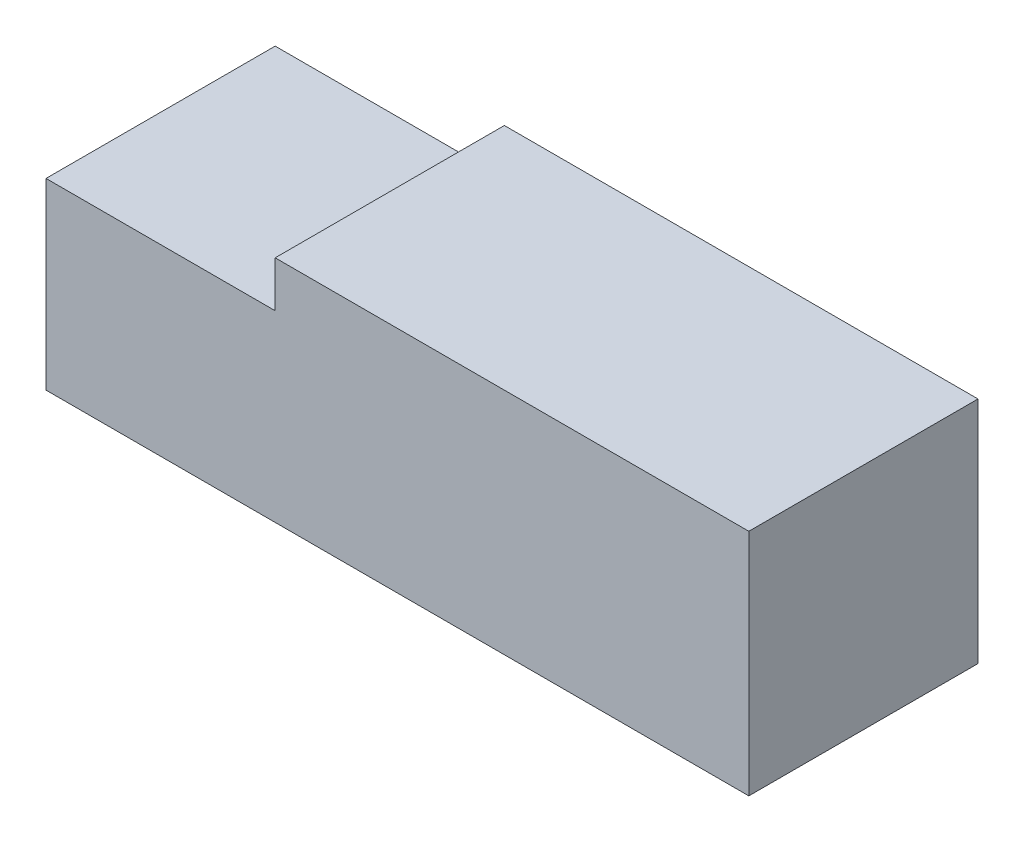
ISO-10303-21;
HEADER;
FILE_DESCRIPTION(('STEP AP214'),'2;1');
FILE_NAME('part.step','',(''),(''),'','','');
FILE_SCHEMA(('AUTOMOTIVE_DESIGN { 1 0 10303 214 1 1 1 1 }'));
ENDSEC;
DATA;
#1=APPLICATION_CONTEXT('core data for automotive mechanical design processes');
#2=APPLICATION_PROTOCOL_DEFINITION('international standard','automotive_design',2000,#1);
#3=PRODUCT_CONTEXT('',#1,'mechanical');
#4=PRODUCT('Part','Part','',(#3));
#5=PRODUCT_RELATED_PRODUCT_CATEGORY('part','',(#4));
#6=PRODUCT_DEFINITION_FORMATION('','',#4);
#7=PRODUCT_DEFINITION_CONTEXT('part definition',#1,'design');
#8=PRODUCT_DEFINITION('design','',#6,#7);
#9=PRODUCT_DEFINITION_SHAPE('','',#8);
#10=(LENGTH_UNIT() NAMED_UNIT(*) SI_UNIT(.MILLI.,.METRE.));
#11=(NAMED_UNIT(*) PLANE_ANGLE_UNIT() SI_UNIT($,.RADIAN.));
#12=(NAMED_UNIT(*) SI_UNIT($,.STERADIAN.) SOLID_ANGLE_UNIT());
#13=UNCERTAINTY_MEASURE_WITH_UNIT(LENGTH_MEASURE(1.E-05),#10,'distance_accuracy_value','');
#14=(GEOMETRIC_REPRESENTATION_CONTEXT(3) GLOBAL_UNCERTAINTY_ASSIGNED_CONTEXT((#13)) GLOBAL_UNIT_ASSIGNED_CONTEXT((#10,
#11,#12)) REPRESENTATION_CONTEXT('',''));
#15=CARTESIAN_POINT('',(0.,0.,0.));
#16=DIRECTION('',(0.,0.,1.));
#17=DIRECTION('',(1.,0.,0.));
#18=AXIS2_PLACEMENT_3D('',#15,#16,#17);
#19=CARTESIAN_POINT('',(-115.,37.5,-57.5));
#20=DIRECTION('',(1.,0.,0.));
#21=DIRECTION('',(0.,0.,-1.));
#22=AXIS2_PLACEMENT_3D('',#19,#20,#21);
#23=PLANE('',#22);
#24=DIRECTION('',(0.,-1.,0.));
#25=VECTOR('',#24,1.);
#26=CARTESIAN_POINT('',(-115.,22.5,17.5));
#27=LINE('',#26,#25);
#28=CARTESIAN_POINT('',(-115.,22.5,17.5));
#29=VERTEX_POINT('',#28);
#30=CARTESIAN_POINT('',(-115.,-37.5,17.5));
#31=VERTEX_POINT('',#30);
#32=EDGE_CURVE('E104',#29,#31,#27,.T.);
#33=ORIENTED_EDGE('',*,*,#32,.F.);
#34=DIRECTION('',(0.,0.,1.));
#35=VECTOR('',#34,1.);
#36=CARTESIAN_POINT('',(-115.,22.5,-57.5));
#37=LINE('',#36,#35);
#38=CARTESIAN_POINT('',(-115.,22.5,-57.5));
#39=VERTEX_POINT('',#38);
#40=EDGE_CURVE('E111',#39,#29,#37,.T.);
#41=ORIENTED_EDGE('',*,*,#40,.F.);
#42=DIRECTION('',(0.,-1.,0.));
#43=VECTOR('',#42,1.);
#44=CARTESIAN_POINT('',(-115.,37.5,-57.5));
#45=LINE('',#44,#43);
#46=CARTESIAN_POINT('',(-115.,-37.5,-57.5));
#47=VERTEX_POINT('',#46);
#48=EDGE_CURVE('E47',#39,#47,#45,.T.);
#49=ORIENTED_EDGE('',*,*,#48,.T.);
#50=DIRECTION('',(0.,0.,1.));
#51=VECTOR('',#50,1.);
#52=CARTESIAN_POINT('',(-115.,-37.5,-57.5));
#53=LINE('',#52,#51);
#54=EDGE_CURVE('E114',#47,#31,#53,.T.);
#55=ORIENTED_EDGE('',*,*,#54,.T.);
#56=EDGE_LOOP('',(#33,#41,#49,#55));
#57=FACE_BOUND('',#56,.T.);
#58=ADVANCED_FACE('F38',(#57),#23,.F.);
#59=CARTESIAN_POINT('',(115.,37.5,-57.5));
#60=DIRECTION('',(-1.,0.,0.));
#61=DIRECTION('',(0.,0.,1.));
#62=AXIS2_PLACEMENT_3D('',#59,#60,#61);
#63=PLANE('',#62);
#64=DIRECTION('',(0.,1.,0.));
#65=VECTOR('',#64,1.);
#66=CARTESIAN_POINT('',(115.,37.5,17.5));
#67=LINE('',#66,#65);
#68=CARTESIAN_POINT('',(115.,-37.5,17.5));
#69=VERTEX_POINT('',#68);
#70=CARTESIAN_POINT('',(115.,37.5,17.5));
#71=VERTEX_POINT('',#70);
#72=EDGE_CURVE('E155',#69,#71,#67,.T.);
#73=ORIENTED_EDGE('',*,*,#72,.F.);
#74=DIRECTION('',(0.,0.,-1.));
#75=VECTOR('',#74,1.);
#76=CARTESIAN_POINT('',(115.,-37.5,-57.5));
#77=LINE('',#76,#75);
#78=CARTESIAN_POINT('',(115.,-37.5,-57.5));
#79=VERTEX_POINT('',#78);
#80=EDGE_CURVE('E77',#69,#79,#77,.T.);
#81=ORIENTED_EDGE('',*,*,#80,.T.);
#82=DIRECTION('',(0.,-1.,0.));
#83=VECTOR('',#82,1.);
#84=CARTESIAN_POINT('',(115.,37.5,-57.5));
#85=LINE('',#84,#83);
#86=CARTESIAN_POINT('',(115.,37.5,-57.5));
#87=VERTEX_POINT('',#86);
#88=EDGE_CURVE('E11',#87,#79,#85,.T.);
#89=ORIENTED_EDGE('',*,*,#88,.F.);
#90=DIRECTION('',(0.,0.,-1.));
#91=VECTOR('',#90,1.);
#92=CARTESIAN_POINT('',(115.,37.5,-57.5));
#93=LINE('',#92,#91);
#94=EDGE_CURVE('E63',#71,#87,#93,.T.);
#95=ORIENTED_EDGE('',*,*,#94,.F.);
#96=EDGE_LOOP('',(#73,#81,#89,#95));
#97=FACE_BOUND('',#96,.T.);
#98=ADVANCED_FACE('F40',(#97),#63,.F.);
#99=CARTESIAN_POINT('',(0.,37.5,0.));
#100=DIRECTION('',(0.,1.,0.));
#101=DIRECTION('',(0.,0.,1.));
#102=AXIS2_PLACEMENT_3D('',#99,#100,#101);
#103=PLANE('',#102);
#104=DIRECTION('',(0.,0.,-1.));
#105=VECTOR('',#104,1.);
#106=CARTESIAN_POINT('',(-40.,37.5,-57.5));
#107=LINE('',#106,#105);
#108=CARTESIAN_POINT('',(-40.,37.5,17.5));
#109=VERTEX_POINT('',#108);
#110=CARTESIAN_POINT('',(-40.,37.5,-57.5));
#111=VERTEX_POINT('',#110);
#112=EDGE_CURVE('E121',#109,#111,#107,.T.);
#113=ORIENTED_EDGE('',*,*,#112,.F.);
#114=DIRECTION('',(-1.,0.,0.));
#115=VECTOR('',#114,1.);
#116=CARTESIAN_POINT('',(-40.,37.5,17.5));
#117=LINE('',#116,#115);
#118=EDGE_CURVE('E158',#71,#109,#117,.T.);
#119=ORIENTED_EDGE('',*,*,#118,.F.);
#120=ORIENTED_EDGE('',*,*,#94,.T.);
#121=DIRECTION('',(-1.,0.,0.));
#122=VECTOR('',#121,1.);
#123=CARTESIAN_POINT('',(-115.,37.5,-57.5));
#124=LINE('',#123,#122);
#125=EDGE_CURVE('E139',#87,#111,#124,.T.);
#126=ORIENTED_EDGE('',*,*,#125,.T.);
#127=EDGE_LOOP('',(#113,#119,#120,#126));
#128=FACE_BOUND('',#127,.T.);
#129=ADVANCED_FACE('F166',(#128),#103,.T.);
#130=CARTESIAN_POINT('',(0.,-37.5,0.));
#131=DIRECTION('',(0.,1.,0.));
#132=DIRECTION('',(0.,0.,1.));
#133=AXIS2_PLACEMENT_3D('',#130,#131,#132);
#134=PLANE('',#133);
#135=DIRECTION('',(1.,0.,0.));
#136=VECTOR('',#135,1.);
#137=CARTESIAN_POINT('',(-115.,-37.5,17.5));
#138=LINE('',#137,#136);
#139=EDGE_CURVE('E116',#31,#69,#138,.T.);
#140=ORIENTED_EDGE('',*,*,#139,.F.);
#141=ORIENTED_EDGE('',*,*,#54,.F.);
#142=DIRECTION('',(-1.,0.,0.));
#143=VECTOR('',#142,1.);
#144=CARTESIAN_POINT('',(-115.,-37.5,-57.5));
#145=LINE('',#144,#143);
#146=EDGE_CURVE('E144',#79,#47,#145,.T.);
#147=ORIENTED_EDGE('',*,*,#146,.F.);
#148=ORIENTED_EDGE('',*,*,#80,.F.);
#149=EDGE_LOOP('',(#140,#141,#147,#148));
#150=FACE_BOUND('',#149,.T.);
#151=ADVANCED_FACE('F153',(#150),#134,.F.);
#152=CARTESIAN_POINT('',(-40.,22.5,-57.5));
#153=DIRECTION('',(1.,0.,0.));
#154=DIRECTION('',(0.,0.,-1.));
#155=AXIS2_PLACEMENT_3D('',#152,#153,#154);
#156=PLANE('',#155);
#157=DIRECTION('',(0.,-1.,0.));
#158=VECTOR('',#157,1.);
#159=CARTESIAN_POINT('',(-40.,22.5,17.5));
#160=LINE('',#159,#158);
#161=CARTESIAN_POINT('',(-40.,22.5,17.5));
#162=VERTEX_POINT('',#161);
#163=EDGE_CURVE('E54',#109,#162,#160,.T.);
#164=ORIENTED_EDGE('',*,*,#163,.F.);
#165=ORIENTED_EDGE('',*,*,#112,.T.);
#166=DIRECTION('',(0.,1.,0.));
#167=VECTOR('',#166,1.);
#168=CARTESIAN_POINT('',(-40.,22.5,-57.5));
#169=LINE('',#168,#167);
#170=CARTESIAN_POINT('',(-40.,22.5,-57.5));
#171=VERTEX_POINT('',#170);
#172=EDGE_CURVE('E132',#171,#111,#169,.T.);
#173=ORIENTED_EDGE('',*,*,#172,.F.);
#174=DIRECTION('',(0.,0.,-1.));
#175=VECTOR('',#174,1.);
#176=CARTESIAN_POINT('',(-40.,22.5,-57.5));
#177=LINE('',#176,#175);
#178=EDGE_CURVE('E120',#162,#171,#177,.T.);
#179=ORIENTED_EDGE('',*,*,#178,.F.);
#180=EDGE_LOOP('',(#164,#165,#173,#179));
#181=FACE_BOUND('',#180,.T.);
#182=ADVANCED_FACE('F164',(#181),#156,.F.);
#183=CARTESIAN_POINT('',(0.,22.5,0.));
#184=DIRECTION('',(0.,1.,0.));
#185=DIRECTION('',(0.,0.,1.));
#186=AXIS2_PLACEMENT_3D('',#183,#184,#185);
#187=PLANE('',#186);
#188=ORIENTED_EDGE('',*,*,#40,.T.);
#189=DIRECTION('',(-1.,0.,0.));
#190=VECTOR('',#189,1.);
#191=CARTESIAN_POINT('',(-115.,22.5,17.5));
#192=LINE('',#191,#190);
#193=EDGE_CURVE('E101',#162,#29,#192,.T.);
#194=ORIENTED_EDGE('',*,*,#193,.F.);
#195=ORIENTED_EDGE('',*,*,#178,.T.);
#196=DIRECTION('',(-1.,0.,0.));
#197=VECTOR('',#196,1.);
#198=CARTESIAN_POINT('',(-115.,22.5,-57.5));
#199=LINE('',#198,#197);
#200=EDGE_CURVE('E85',#171,#39,#199,.T.);
#201=ORIENTED_EDGE('',*,*,#200,.T.);
#202=EDGE_LOOP('',(#188,#194,#195,#201));
#203=FACE_BOUND('',#202,.T.);
#204=ADVANCED_FACE('F118',(#203),#187,.T.);
#205=CARTESIAN_POINT('',(-115.,37.5,-57.5));
#206=DIRECTION('',(0.,0.,1.));
#207=DIRECTION('',(1.,0.,0.));
#208=AXIS2_PLACEMENT_3D('',#205,#206,#207);
#209=PLANE('',#208);
#210=ORIENTED_EDGE('',*,*,#200,.F.);
#211=ORIENTED_EDGE('',*,*,#172,.T.);
#212=ORIENTED_EDGE('',*,*,#125,.F.);
#213=ORIENTED_EDGE('',*,*,#88,.T.);
#214=ORIENTED_EDGE('',*,*,#146,.T.);
#215=ORIENTED_EDGE('',*,*,#48,.F.);
#216=EDGE_LOOP('',(#210,#211,#212,#213,#214,#215));
#217=FACE_BOUND('',#216,.T.);
#218=ADVANCED_FACE('F151',(#217),#209,.F.);
#219=CARTESIAN_POINT('',(0.,0.,17.5));
#220=DIRECTION('',(0.,0.,1.));
#221=DIRECTION('',(1.,0.,0.));
#222=AXIS2_PLACEMENT_3D('',#219,#220,#221);
#223=PLANE('',#222);
#224=ORIENTED_EDGE('',*,*,#193,.T.);
#225=ORIENTED_EDGE('',*,*,#32,.T.);
#226=ORIENTED_EDGE('',*,*,#139,.T.);
#227=ORIENTED_EDGE('',*,*,#72,.T.);
#228=ORIENTED_EDGE('',*,*,#118,.T.);
#229=ORIENTED_EDGE('',*,*,#163,.T.);
#230=EDGE_LOOP('',(#224,#225,#226,#227,#228,#229));
#231=FACE_BOUND('',#230,.T.);
#232=ADVANCED_FACE('F103',(#231),#223,.T.);
#233=CLOSED_SHELL('',(#58,#98,#129,#151,#182,#204,#218,#232));
#234=MANIFOLD_SOLID_BREP('B2',#233);
#235=ADVANCED_BREP_SHAPE_REPRESENTATION('',(#18,#234),#14);
#236=SHAPE_DEFINITION_REPRESENTATION(#9,#235);
ENDSEC;
END-ISO-10303-21;
